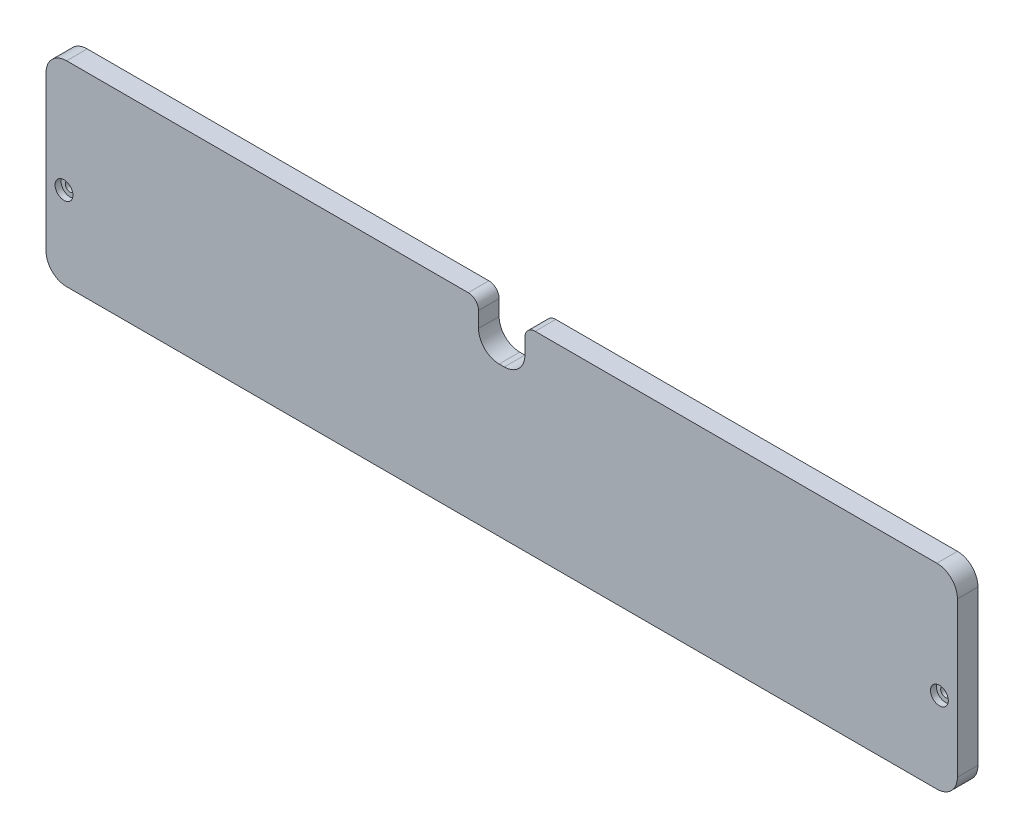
ISO-10303-21;
HEADER;
FILE_DESCRIPTION(('STEP AP214'),'2;1');
FILE_NAME('part.step','',(''),(''),'','','');
FILE_SCHEMA(('AUTOMOTIVE_DESIGN { 1 0 10303 214 1 1 1 1 }'));
ENDSEC;
DATA;
#1=APPLICATION_CONTEXT('core data for automotive mechanical design processes');
#2=APPLICATION_PROTOCOL_DEFINITION('international standard','automotive_design',2000,#1);
#3=PRODUCT_CONTEXT('',#1,'mechanical');
#4=PRODUCT('Part','Part','',(#3));
#5=PRODUCT_RELATED_PRODUCT_CATEGORY('part','',(#4));
#6=PRODUCT_DEFINITION_FORMATION('','',#4);
#7=PRODUCT_DEFINITION_CONTEXT('part definition',#1,'design');
#8=PRODUCT_DEFINITION('design','',#6,#7);
#9=PRODUCT_DEFINITION_SHAPE('','',#8);
#10=(LENGTH_UNIT() NAMED_UNIT(*) SI_UNIT(.MILLI.,.METRE.));
#11=(NAMED_UNIT(*) PLANE_ANGLE_UNIT() SI_UNIT($,.RADIAN.));
#12=(NAMED_UNIT(*) SI_UNIT($,.STERADIAN.) SOLID_ANGLE_UNIT());
#13=UNCERTAINTY_MEASURE_WITH_UNIT(LENGTH_MEASURE(1.E-05),#10,'distance_accuracy_value','');
#14=(GEOMETRIC_REPRESENTATION_CONTEXT(3) GLOBAL_UNCERTAINTY_ASSIGNED_CONTEXT((#13)) GLOBAL_UNIT_ASSIGNED_CONTEXT((#10,
#11,#12)) REPRESENTATION_CONTEXT('',''));
#15=CARTESIAN_POINT('',(0.,0.,0.));
#16=DIRECTION('',(0.,0.,1.));
#17=DIRECTION('',(1.,0.,0.));
#18=AXIS2_PLACEMENT_3D('',#15,#16,#17);
#19=CARTESIAN_POINT('',(12.7,12.7,12.7));
#20=DIRECTION('',(0.,0.,-1.));
#21=DIRECTION('',(-1.,0.,0.));
#22=AXIS2_PLACEMENT_3D('',#19,#20,#21);
#23=CYLINDRICAL_SURFACE('',#22,12.7);
#24=CARTESIAN_POINT('',(12.7,12.7,0.));
#25=DIRECTION('',(0.,0.,1.));
#26=DIRECTION('',(1.,0.,0.));
#27=AXIS2_PLACEMENT_3D('',#24,#25,#26);
#28=CIRCLE('',#27,12.7);
#29=CARTESIAN_POINT('',(0.,12.7000000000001,0.));
#30=VERTEX_POINT('',#29);
#31=CARTESIAN_POINT('',(12.7000000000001,0.,0.));
#32=VERTEX_POINT('',#31);
#33=EDGE_CURVE('E176',#30,#32,#28,.T.);
#34=ORIENTED_EDGE('',*,*,#33,.T.);
#35=DIRECTION('',(0.,0.,-1.));
#36=VECTOR('',#35,1.);
#37=CARTESIAN_POINT('',(12.7000000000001,0.,12.7));
#38=LINE('',#37,#36);
#39=CARTESIAN_POINT('',(12.7000000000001,0.,12.7));
#40=VERTEX_POINT('',#39);
#41=EDGE_CURVE('E11',#40,#32,#38,.T.);
#42=ORIENTED_EDGE('',*,*,#41,.F.);
#43=CARTESIAN_POINT('',(12.7,12.7,12.7));
#44=DIRECTION('',(0.,0.,1.));
#45=DIRECTION('',(1.,0.,0.));
#46=AXIS2_PLACEMENT_3D('',#43,#44,#45);
#47=CIRCLE('',#46,12.7);
#48=CARTESIAN_POINT('',(0.,12.7000000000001,12.7));
#49=VERTEX_POINT('',#48);
#50=EDGE_CURVE('E207',#49,#40,#47,.T.);
#51=ORIENTED_EDGE('',*,*,#50,.F.);
#52=DIRECTION('',(0.,0.,-1.));
#53=VECTOR('',#52,1.);
#54=CARTESIAN_POINT('',(0.,12.7000000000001,12.7));
#55=LINE('',#54,#53);
#56=EDGE_CURVE('E172',#49,#30,#55,.T.);
#57=ORIENTED_EDGE('',*,*,#56,.T.);
#58=EDGE_LOOP('',(#34,#42,#51,#57));
#59=FACE_BOUND('',#58,.T.);
#60=ADVANCED_FACE('F32',(#59),#23,.T.);
#61=CARTESIAN_POINT('',(12.7000000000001,0.,12.7));
#62=DIRECTION('',(0.,1.,0.));
#63=DIRECTION('',(0.,0.,1.));
#64=AXIS2_PLACEMENT_3D('',#61,#62,#63);
#65=PLANE('',#64);
#66=DIRECTION('',(1.,0.,0.));
#67=VECTOR('',#66,1.);
#68=CARTESIAN_POINT('',(12.7000000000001,0.,0.));
#69=LINE('',#68,#67);
#70=CARTESIAN_POINT('',(549.275,0.,0.));
#71=VERTEX_POINT('',#70);
#72=EDGE_CURVE('E179',#32,#71,#69,.T.);
#73=ORIENTED_EDGE('',*,*,#72,.T.);
#74=DIRECTION('',(0.,0.,-1.));
#75=VECTOR('',#74,1.);
#76=CARTESIAN_POINT('',(549.275,0.,12.7));
#77=LINE('',#76,#75);
#78=CARTESIAN_POINT('',(549.275,0.,12.7));
#79=VERTEX_POINT('',#78);
#80=EDGE_CURVE('E40',#79,#71,#77,.T.);
#81=ORIENTED_EDGE('',*,*,#80,.F.);
#82=DIRECTION('',(1.,0.,0.));
#83=VECTOR('',#82,1.);
#84=CARTESIAN_POINT('',(12.7000000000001,0.,12.7));
#85=LINE('',#84,#83);
#86=EDGE_CURVE('E115',#40,#79,#85,.T.);
#87=ORIENTED_EDGE('',*,*,#86,.F.);
#88=ORIENTED_EDGE('',*,*,#41,.T.);
#89=EDGE_LOOP('',(#73,#81,#87,#88));
#90=FACE_BOUND('',#89,.T.);
#91=ADVANCED_FACE('F306',(#90),#65,.F.);
#92=CARTESIAN_POINT('',(549.275,12.7,12.7));
#93=DIRECTION('',(0.,0.,-1.));
#94=DIRECTION('',(-1.,0.,0.));
#95=AXIS2_PLACEMENT_3D('',#92,#93,#94);
#96=CYLINDRICAL_SURFACE('',#95,12.7);
#97=CARTESIAN_POINT('',(549.275,12.7,0.));
#98=DIRECTION('',(0.,0.,1.));
#99=DIRECTION('',(1.,0.,0.));
#100=AXIS2_PLACEMENT_3D('',#97,#98,#99);
#101=CIRCLE('',#100,12.7);
#102=CARTESIAN_POINT('',(561.975,12.7000000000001,0.));
#103=VERTEX_POINT('',#102);
#104=EDGE_CURVE('E182',#71,#103,#101,.T.);
#105=ORIENTED_EDGE('',*,*,#104,.T.);
#106=DIRECTION('',(0.,0.,-1.));
#107=VECTOR('',#106,1.);
#108=CARTESIAN_POINT('',(561.975,12.7000000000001,12.7));
#109=LINE('',#108,#107);
#110=CARTESIAN_POINT('',(561.975,12.7000000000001,12.7));
#111=VERTEX_POINT('',#110);
#112=EDGE_CURVE('E238',#111,#103,#109,.T.);
#113=ORIENTED_EDGE('',*,*,#112,.F.);
#114=CARTESIAN_POINT('',(549.275,12.7,12.7));
#115=DIRECTION('',(0.,0.,1.));
#116=DIRECTION('',(1.,0.,0.));
#117=AXIS2_PLACEMENT_3D('',#114,#115,#116);
#118=CIRCLE('',#117,12.7);
#119=EDGE_CURVE('E246',#79,#111,#118,.T.);
#120=ORIENTED_EDGE('',*,*,#119,.F.);
#121=ORIENTED_EDGE('',*,*,#80,.T.);
#122=EDGE_LOOP('',(#105,#113,#120,#121));
#123=FACE_BOUND('',#122,.T.);
#124=ADVANCED_FACE('F244',(#123),#96,.T.);
#125=CARTESIAN_POINT('',(561.975,12.7000000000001,12.7));
#126=DIRECTION('',(-1.,0.,0.));
#127=DIRECTION('',(0.,0.,1.));
#128=AXIS2_PLACEMENT_3D('',#125,#126,#127);
#129=PLANE('',#128);
#130=DIRECTION('',(0.,1.,0.));
#131=VECTOR('',#130,1.);
#132=CARTESIAN_POINT('',(561.975,12.7000000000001,0.));
#133=LINE('',#132,#131);
#134=CARTESIAN_POINT('',(561.975,107.95,0.));
#135=VERTEX_POINT('',#134);
#136=EDGE_CURVE('E184',#103,#135,#133,.T.);
#137=ORIENTED_EDGE('',*,*,#136,.T.);
#138=DIRECTION('',(0.,0.,-1.));
#139=VECTOR('',#138,1.);
#140=CARTESIAN_POINT('',(561.975,107.95,12.7));
#141=LINE('',#140,#139);
#142=CARTESIAN_POINT('',(561.975,107.95,12.7));
#143=VERTEX_POINT('',#142);
#144=EDGE_CURVE('E235',#143,#135,#141,.T.);
#145=ORIENTED_EDGE('',*,*,#144,.F.);
#146=DIRECTION('',(0.,1.,0.));
#147=VECTOR('',#146,1.);
#148=CARTESIAN_POINT('',(561.975,12.7000000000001,12.7));
#149=LINE('',#148,#147);
#150=EDGE_CURVE('E264',#111,#143,#149,.T.);
#151=ORIENTED_EDGE('',*,*,#150,.F.);
#152=ORIENTED_EDGE('',*,*,#112,.T.);
#153=EDGE_LOOP('',(#137,#145,#151,#152));
#154=FACE_BOUND('',#153,.T.);
#155=ADVANCED_FACE('F255',(#154),#129,.F.);
#156=CARTESIAN_POINT('',(549.275,107.95,12.7));
#157=DIRECTION('',(0.,0.,-1.));
#158=DIRECTION('',(-1.,0.,0.));
#159=AXIS2_PLACEMENT_3D('',#156,#157,#158);
#160=CYLINDRICAL_SURFACE('',#159,12.7);
#161=CARTESIAN_POINT('',(549.275,107.95,0.));
#162=DIRECTION('',(0.,0.,1.));
#163=DIRECTION('',(1.,0.,0.));
#164=AXIS2_PLACEMENT_3D('',#161,#162,#163);
#165=CIRCLE('',#164,12.7);
#166=CARTESIAN_POINT('',(549.275,120.65,0.));
#167=VERTEX_POINT('',#166);
#168=EDGE_CURVE('E186',#135,#167,#165,.T.);
#169=ORIENTED_EDGE('',*,*,#168,.T.);
#170=DIRECTION('',(0.,0.,-1.));
#171=VECTOR('',#170,1.);
#172=CARTESIAN_POINT('',(549.275,120.65,12.7));
#173=LINE('',#172,#171);
#174=CARTESIAN_POINT('',(549.275,120.65,12.7));
#175=VERTEX_POINT('',#174);
#176=EDGE_CURVE('E232',#175,#167,#173,.T.);
#177=ORIENTED_EDGE('',*,*,#176,.F.);
#178=CARTESIAN_POINT('',(549.275,107.95,12.7));
#179=DIRECTION('',(0.,0.,1.));
#180=DIRECTION('',(1.,0.,0.));
#181=AXIS2_PLACEMENT_3D('',#178,#179,#180);
#182=CIRCLE('',#181,12.7);
#183=EDGE_CURVE('E261',#143,#175,#182,.T.);
#184=ORIENTED_EDGE('',*,*,#183,.F.);
#185=ORIENTED_EDGE('',*,*,#144,.T.);
#186=EDGE_LOOP('',(#169,#177,#184,#185));
#187=FACE_BOUND('',#186,.T.);
#188=ADVANCED_FACE('F259',(#187),#160,.T.);
#189=CARTESIAN_POINT('',(549.275,120.65,12.7));
#190=DIRECTION('',(0.,-1.,0.));
#191=DIRECTION('',(1.,0.,0.));
#192=AXIS2_PLACEMENT_3D('',#189,#190,#191);
#193=PLANE('',#192);
#194=DIRECTION('',(-1.,0.,0.));
#195=VECTOR('',#194,1.);
#196=CARTESIAN_POINT('',(549.275,120.65,0.));
#197=LINE('',#196,#195);
#198=CARTESIAN_POINT('',(301.625,120.65,0.));
#199=VERTEX_POINT('',#198);
#200=EDGE_CURVE('E188',#167,#199,#197,.T.);
#201=ORIENTED_EDGE('',*,*,#200,.T.);
#202=DIRECTION('',(0.,0.,-1.));
#203=VECTOR('',#202,1.);
#204=CARTESIAN_POINT('',(301.625,120.65,12.7));
#205=LINE('',#204,#203);
#206=CARTESIAN_POINT('',(301.625,120.65,12.7));
#207=VERTEX_POINT('',#206);
#208=EDGE_CURVE('E229',#207,#199,#205,.T.);
#209=ORIENTED_EDGE('',*,*,#208,.F.);
#210=DIRECTION('',(-1.,0.,0.));
#211=VECTOR('',#210,1.);
#212=CARTESIAN_POINT('',(549.275,120.65,12.7));
#213=LINE('',#212,#211);
#214=EDGE_CURVE('E263',#175,#207,#213,.T.);
#215=ORIENTED_EDGE('',*,*,#214,.F.);
#216=ORIENTED_EDGE('',*,*,#176,.T.);
#217=EDGE_LOOP('',(#201,#209,#215,#216));
#218=FACE_BOUND('',#217,.T.);
#219=ADVANCED_FACE('F319',(#218),#193,.F.);
#220=CARTESIAN_POINT('',(301.625,114.3,12.7));
#221=DIRECTION('',(0.,0.,-1.));
#222=DIRECTION('',(-1.,0.,0.));
#223=AXIS2_PLACEMENT_3D('',#220,#221,#222);
#224=CYLINDRICAL_SURFACE('',#223,6.35);
#225=CARTESIAN_POINT('',(301.625,114.3,0.));
#226=DIRECTION('',(0.,0.,1.));
#227=DIRECTION('',(1.,0.,0.));
#228=AXIS2_PLACEMENT_3D('',#225,#226,#227);
#229=CIRCLE('',#228,6.35);
#230=CARTESIAN_POINT('',(295.275,114.3,0.));
#231=VERTEX_POINT('',#230);
#232=EDGE_CURVE('E190',#199,#231,#229,.T.);
#233=ORIENTED_EDGE('',*,*,#232,.T.);
#234=DIRECTION('',(0.,0.,-1.));
#235=VECTOR('',#234,1.);
#236=CARTESIAN_POINT('',(295.275,114.3,12.7));
#237=LINE('',#236,#235);
#238=CARTESIAN_POINT('',(295.275,114.3,12.7));
#239=VERTEX_POINT('',#238);
#240=EDGE_CURVE('E226',#239,#231,#237,.T.);
#241=ORIENTED_EDGE('',*,*,#240,.F.);
#242=CARTESIAN_POINT('',(301.625,114.3,12.7));
#243=DIRECTION('',(0.,0.,1.));
#244=DIRECTION('',(1.,0.,0.));
#245=AXIS2_PLACEMENT_3D('',#242,#243,#244);
#246=CIRCLE('',#245,6.35);
#247=EDGE_CURVE('E266',#207,#239,#246,.T.);
#248=ORIENTED_EDGE('',*,*,#247,.F.);
#249=ORIENTED_EDGE('',*,*,#208,.T.);
#250=EDGE_LOOP('',(#233,#241,#248,#249));
#251=FACE_BOUND('',#250,.T.);
#252=ADVANCED_FACE('F322',(#251),#224,.T.);
#253=CARTESIAN_POINT('',(295.275,114.3,12.7));
#254=DIRECTION('',(1.,0.,0.));
#255=DIRECTION('',(0.,0.,-1.));
#256=AXIS2_PLACEMENT_3D('',#253,#254,#255);
#257=PLANE('',#256);
#258=DIRECTION('',(0.,-1.,0.));
#259=VECTOR('',#258,1.);
#260=CARTESIAN_POINT('',(295.275,114.3,0.));
#261=LINE('',#260,#259);
#262=CARTESIAN_POINT('',(295.275,104.775,0.));
#263=VERTEX_POINT('',#262);
#264=EDGE_CURVE('E192',#231,#263,#261,.T.);
#265=ORIENTED_EDGE('',*,*,#264,.T.);
#266=DIRECTION('',(0.,0.,-1.));
#267=VECTOR('',#266,1.);
#268=CARTESIAN_POINT('',(295.275,104.775,12.7));
#269=LINE('',#268,#267);
#270=CARTESIAN_POINT('',(295.275,104.775,12.7));
#271=VERTEX_POINT('',#270);
#272=EDGE_CURVE('E223',#271,#263,#269,.T.);
#273=ORIENTED_EDGE('',*,*,#272,.F.);
#274=DIRECTION('',(0.,-1.,0.));
#275=VECTOR('',#274,1.);
#276=CARTESIAN_POINT('',(295.275,114.3,12.7));
#277=LINE('',#276,#275);
#278=EDGE_CURVE('E272',#239,#271,#277,.T.);
#279=ORIENTED_EDGE('',*,*,#278,.F.);
#280=ORIENTED_EDGE('',*,*,#240,.T.);
#281=EDGE_LOOP('',(#265,#273,#279,#280));
#282=FACE_BOUND('',#281,.T.);
#283=ADVANCED_FACE('F326',(#282),#257,.F.);
#284=CARTESIAN_POINT('',(282.575,104.775,12.7));
#285=DIRECTION('',(0.,0.,-1.));
#286=DIRECTION('',(-1.,0.,0.));
#287=AXIS2_PLACEMENT_3D('',#284,#285,#286);
#288=CYLINDRICAL_SURFACE('',#287,12.7);
#289=CARTESIAN_POINT('',(282.575,104.775,0.));
#290=DIRECTION('',(0.,0.,-1.));
#291=DIRECTION('',(1.,0.,0.));
#292=AXIS2_PLACEMENT_3D('',#289,#290,#291);
#293=CIRCLE('',#292,12.7);
#294=CARTESIAN_POINT('',(282.575,92.0749999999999,0.));
#295=VERTEX_POINT('',#294);
#296=EDGE_CURVE('E194',#263,#295,#293,.T.);
#297=ORIENTED_EDGE('',*,*,#296,.T.);
#298=DIRECTION('',(0.,0.,-1.));
#299=VECTOR('',#298,1.);
#300=CARTESIAN_POINT('',(282.575,92.0749999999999,12.7));
#301=LINE('',#300,#299);
#302=CARTESIAN_POINT('',(282.575,92.0749999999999,12.7));
#303=VERTEX_POINT('',#302);
#304=EDGE_CURVE('E220',#303,#295,#301,.T.);
#305=ORIENTED_EDGE('',*,*,#304,.F.);
#306=CARTESIAN_POINT('',(282.575,104.775,12.7));
#307=DIRECTION('',(0.,0.,-1.));
#308=DIRECTION('',(1.,0.,0.));
#309=AXIS2_PLACEMENT_3D('',#306,#307,#308);
#310=CIRCLE('',#309,12.7);
#311=EDGE_CURVE('E274',#271,#303,#310,.T.);
#312=ORIENTED_EDGE('',*,*,#311,.F.);
#313=ORIENTED_EDGE('',*,*,#272,.T.);
#314=EDGE_LOOP('',(#297,#305,#312,#313));
#315=FACE_BOUND('',#314,.T.);
#316=ADVANCED_FACE('F330',(#315),#288,.F.);
#317=CARTESIAN_POINT('',(282.575,92.0749999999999,12.7));
#318=DIRECTION('',(0.,-1.,0.));
#319=DIRECTION('',(1.,0.,0.));
#320=AXIS2_PLACEMENT_3D('',#317,#318,#319);
#321=PLANE('',#320);
#322=DIRECTION('',(-1.,0.,0.));
#323=VECTOR('',#322,1.);
#324=CARTESIAN_POINT('',(282.575,92.0749999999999,0.));
#325=LINE('',#324,#323);
#326=CARTESIAN_POINT('',(279.4,92.075,0.));
#327=VERTEX_POINT('',#326);
#328=EDGE_CURVE('E196',#295,#327,#325,.T.);
#329=ORIENTED_EDGE('',*,*,#328,.T.);
#330=DIRECTION('',(0.,0.,-1.));
#331=VECTOR('',#330,1.);
#332=CARTESIAN_POINT('',(279.4,92.075,12.7));
#333=LINE('',#332,#331);
#334=CARTESIAN_POINT('',(279.4,92.075,12.7));
#335=VERTEX_POINT('',#334);
#336=EDGE_CURVE('E217',#335,#327,#333,.T.);
#337=ORIENTED_EDGE('',*,*,#336,.F.);
#338=DIRECTION('',(-1.,0.,0.));
#339=VECTOR('',#338,1.);
#340=CARTESIAN_POINT('',(282.575,92.0749999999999,12.7));
#341=LINE('',#340,#339);
#342=EDGE_CURVE('E276',#303,#335,#341,.T.);
#343=ORIENTED_EDGE('',*,*,#342,.F.);
#344=ORIENTED_EDGE('',*,*,#304,.T.);
#345=EDGE_LOOP('',(#329,#337,#343,#344));
#346=FACE_BOUND('',#345,.T.);
#347=ADVANCED_FACE('F334',(#346),#321,.F.);
#348=CARTESIAN_POINT('',(279.4,104.775,12.7));
#349=DIRECTION('',(0.,0.,-1.));
#350=DIRECTION('',(-1.,0.,0.));
#351=AXIS2_PLACEMENT_3D('',#348,#349,#350);
#352=CYLINDRICAL_SURFACE('',#351,12.7);
#353=CARTESIAN_POINT('',(279.4,104.775,0.));
#354=DIRECTION('',(0.,0.,-1.));
#355=DIRECTION('',(-1.,0.,0.));
#356=AXIS2_PLACEMENT_3D('',#353,#354,#355);
#357=CIRCLE('',#356,12.7);
#358=CARTESIAN_POINT('',(266.7,104.775,0.));
#359=VERTEX_POINT('',#358);
#360=EDGE_CURVE('E198',#327,#359,#357,.T.);
#361=ORIENTED_EDGE('',*,*,#360,.T.);
#362=DIRECTION('',(0.,0.,-1.));
#363=VECTOR('',#362,1.);
#364=CARTESIAN_POINT('',(266.7,104.775,12.7));
#365=LINE('',#364,#363);
#366=CARTESIAN_POINT('',(266.7,104.775,12.7));
#367=VERTEX_POINT('',#366);
#368=EDGE_CURVE('E214',#367,#359,#365,.T.);
#369=ORIENTED_EDGE('',*,*,#368,.F.);
#370=CARTESIAN_POINT('',(279.4,104.775,12.7));
#371=DIRECTION('',(0.,0.,-1.));
#372=DIRECTION('',(-1.,0.,0.));
#373=AXIS2_PLACEMENT_3D('',#370,#371,#372);
#374=CIRCLE('',#373,12.7);
#375=EDGE_CURVE('E278',#335,#367,#374,.T.);
#376=ORIENTED_EDGE('',*,*,#375,.F.);
#377=ORIENTED_EDGE('',*,*,#336,.T.);
#378=EDGE_LOOP('',(#361,#369,#376,#377));
#379=FACE_BOUND('',#378,.T.);
#380=ADVANCED_FACE('F338',(#379),#352,.F.);
#381=CARTESIAN_POINT('',(266.7,104.775,12.7));
#382=DIRECTION('',(-1.,0.,0.));
#383=DIRECTION('',(0.,0.,1.));
#384=AXIS2_PLACEMENT_3D('',#381,#382,#383);
#385=PLANE('',#384);
#386=DIRECTION('',(0.,1.,0.));
#387=VECTOR('',#386,1.);
#388=CARTESIAN_POINT('',(266.7,104.775,0.));
#389=LINE('',#388,#387);
#390=CARTESIAN_POINT('',(266.7,114.3,0.));
#391=VERTEX_POINT('',#390);
#392=EDGE_CURVE('E200',#359,#391,#389,.T.);
#393=ORIENTED_EDGE('',*,*,#392,.T.);
#394=DIRECTION('',(0.,0.,-1.));
#395=VECTOR('',#394,1.);
#396=CARTESIAN_POINT('',(266.7,114.3,12.7));
#397=LINE('',#396,#395);
#398=CARTESIAN_POINT('',(266.7,114.3,12.7));
#399=VERTEX_POINT('',#398);
#400=EDGE_CURVE('E211',#399,#391,#397,.T.);
#401=ORIENTED_EDGE('',*,*,#400,.F.);
#402=DIRECTION('',(0.,1.,0.));
#403=VECTOR('',#402,1.);
#404=CARTESIAN_POINT('',(266.7,104.775,12.7));
#405=LINE('',#404,#403);
#406=EDGE_CURVE('E280',#367,#399,#405,.T.);
#407=ORIENTED_EDGE('',*,*,#406,.F.);
#408=ORIENTED_EDGE('',*,*,#368,.T.);
#409=EDGE_LOOP('',(#393,#401,#407,#408));
#410=FACE_BOUND('',#409,.T.);
#411=ADVANCED_FACE('F286',(#410),#385,.F.);
#412=CARTESIAN_POINT('',(260.35,114.3,12.7));
#413=DIRECTION('',(0.,0.,-1.));
#414=DIRECTION('',(-1.,0.,0.));
#415=AXIS2_PLACEMENT_3D('',#412,#413,#414);
#416=CYLINDRICAL_SURFACE('',#415,6.35);
#417=CARTESIAN_POINT('',(260.35,114.3,0.));
#418=DIRECTION('',(0.,0.,1.));
#419=DIRECTION('',(1.,0.,0.));
#420=AXIS2_PLACEMENT_3D('',#417,#418,#419);
#421=CIRCLE('',#420,6.35);
#422=CARTESIAN_POINT('',(260.35,120.65,0.));
#423=VERTEX_POINT('',#422);
#424=EDGE_CURVE('E202',#391,#423,#421,.T.);
#425=ORIENTED_EDGE('',*,*,#424,.T.);
#426=DIRECTION('',(0.,0.,-1.));
#427=VECTOR('',#426,1.);
#428=CARTESIAN_POINT('',(260.35,120.65,12.7));
#429=LINE('',#428,#427);
#430=CARTESIAN_POINT('',(260.35,120.65,12.7));
#431=VERTEX_POINT('',#430);
#432=EDGE_CURVE('E167',#431,#423,#429,.T.);
#433=ORIENTED_EDGE('',*,*,#432,.F.);
#434=CARTESIAN_POINT('',(260.35,114.3,12.7));
#435=DIRECTION('',(0.,0.,1.));
#436=DIRECTION('',(1.,0.,0.));
#437=AXIS2_PLACEMENT_3D('',#434,#435,#436);
#438=CIRCLE('',#437,6.35);
#439=EDGE_CURVE('E158',#399,#431,#438,.T.);
#440=ORIENTED_EDGE('',*,*,#439,.F.);
#441=ORIENTED_EDGE('',*,*,#400,.T.);
#442=EDGE_LOOP('',(#425,#433,#440,#441));
#443=FACE_BOUND('',#442,.T.);
#444=ADVANCED_FACE('F290',(#443),#416,.T.);
#445=CARTESIAN_POINT('',(260.35,120.65,12.7));
#446=DIRECTION('',(0.,-1.,0.));
#447=DIRECTION('',(1.,0.,0.));
#448=AXIS2_PLACEMENT_3D('',#445,#446,#447);
#449=PLANE('',#448);
#450=DIRECTION('',(-1.,0.,0.));
#451=VECTOR('',#450,1.);
#452=CARTESIAN_POINT('',(260.35,120.65,0.));
#453=LINE('',#452,#451);
#454=CARTESIAN_POINT('',(12.7,120.65,0.));
#455=VERTEX_POINT('',#454);
#456=EDGE_CURVE('E166',#423,#455,#453,.T.);
#457=ORIENTED_EDGE('',*,*,#456,.T.);
#458=DIRECTION('',(0.,0.,-1.));
#459=VECTOR('',#458,1.);
#460=CARTESIAN_POINT('',(12.7,120.65,12.7));
#461=LINE('',#460,#459);
#462=CARTESIAN_POINT('',(12.7,120.65,12.7));
#463=VERTEX_POINT('',#462);
#464=EDGE_CURVE('E163',#463,#455,#461,.T.);
#465=ORIENTED_EDGE('',*,*,#464,.F.);
#466=DIRECTION('',(-1.,0.,0.));
#467=VECTOR('',#466,1.);
#468=CARTESIAN_POINT('',(260.35,120.65,12.7));
#469=LINE('',#468,#467);
#470=EDGE_CURVE('E152',#431,#463,#469,.T.);
#471=ORIENTED_EDGE('',*,*,#470,.F.);
#472=ORIENTED_EDGE('',*,*,#432,.T.);
#473=EDGE_LOOP('',(#457,#465,#471,#472));
#474=FACE_BOUND('',#473,.T.);
#475=ADVANCED_FACE('F164',(#474),#449,.F.);
#476=CARTESIAN_POINT('',(12.7,107.95,12.7));
#477=DIRECTION('',(0.,0.,-1.));
#478=DIRECTION('',(-1.,0.,0.));
#479=AXIS2_PLACEMENT_3D('',#476,#477,#478);
#480=CYLINDRICAL_SURFACE('',#479,12.7);
#481=CARTESIAN_POINT('',(12.7,107.95,0.));
#482=DIRECTION('',(0.,0.,1.));
#483=DIRECTION('',(1.,0.,0.));
#484=AXIS2_PLACEMENT_3D('',#481,#482,#483);
#485=CIRCLE('',#484,12.7);
#486=CARTESIAN_POINT('',(0.,107.95,0.));
#487=VERTEX_POINT('',#486);
#488=EDGE_CURVE('E101',#455,#487,#485,.T.);
#489=ORIENTED_EDGE('',*,*,#488,.T.);
#490=DIRECTION('',(0.,0.,-1.));
#491=VECTOR('',#490,1.);
#492=CARTESIAN_POINT('',(0.,107.95,12.7));
#493=LINE('',#492,#491);
#494=CARTESIAN_POINT('',(0.,107.95,12.7));
#495=VERTEX_POINT('',#494);
#496=EDGE_CURVE('E168',#495,#487,#493,.T.);
#497=ORIENTED_EDGE('',*,*,#496,.F.);
#498=CARTESIAN_POINT('',(12.7,107.95,12.7));
#499=DIRECTION('',(0.,0.,1.));
#500=DIRECTION('',(1.,0.,0.));
#501=AXIS2_PLACEMENT_3D('',#498,#499,#500);
#502=CIRCLE('',#501,12.7);
#503=EDGE_CURVE('E156',#463,#495,#502,.T.);
#504=ORIENTED_EDGE('',*,*,#503,.F.);
#505=ORIENTED_EDGE('',*,*,#464,.T.);
#506=EDGE_LOOP('',(#489,#497,#504,#505));
#507=FACE_BOUND('',#506,.T.);
#508=ADVANCED_FACE('F170',(#507),#480,.T.);
#509=CARTESIAN_POINT('',(0.,107.95,12.7));
#510=DIRECTION('',(1.,0.,0.));
#511=DIRECTION('',(0.,0.,-1.));
#512=AXIS2_PLACEMENT_3D('',#509,#510,#511);
#513=PLANE('',#512);
#514=DIRECTION('',(0.,-1.,0.));
#515=VECTOR('',#514,1.);
#516=CARTESIAN_POINT('',(0.,107.95,0.));
#517=LINE('',#516,#515);
#518=EDGE_CURVE('E107',#487,#30,#517,.T.);
#519=ORIENTED_EDGE('',*,*,#518,.T.);
#520=ORIENTED_EDGE('',*,*,#56,.F.);
#521=DIRECTION('',(0.,-1.,0.));
#522=VECTOR('',#521,1.);
#523=CARTESIAN_POINT('',(0.,107.95,12.7));
#524=LINE('',#523,#522);
#525=EDGE_CURVE('E48',#495,#49,#524,.T.);
#526=ORIENTED_EDGE('',*,*,#525,.F.);
#527=ORIENTED_EDGE('',*,*,#496,.T.);
#528=EDGE_LOOP('',(#519,#520,#526,#527));
#529=FACE_BOUND('',#528,.T.);
#530=ADVANCED_FACE('F294',(#529),#513,.F.);
#531=CARTESIAN_POINT('',(12.7,12.7,12.7));
#532=DIRECTION('',(0.,0.,1.));
#533=DIRECTION('',(1.,0.,0.));
#534=AXIS2_PLACEMENT_3D('',#531,#532,#533);
#535=PLANE('',#534);
#536=CARTESIAN_POINT('',(11.1125,50.8,12.7));
#537=DIRECTION('',(0.,0.,1.));
#538=DIRECTION('',(1.,0.,0.));
#539=AXIS2_PLACEMENT_3D('',#536,#537,#538);
#540=CIRCLE('',#539,5.49999999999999);
#541=CARTESIAN_POINT('',(16.6125,50.8,12.7));
#542=VERTEX_POINT('',#541);
#543=EDGE_CURVE('E444',#542,#542,#540,.T.);
#544=ORIENTED_EDGE('',*,*,#543,.F.);
#545=EDGE_LOOP('',(#544));
#546=FACE_BOUND('',#545,.T.);
#547=CARTESIAN_POINT('',(550.8625,50.8,12.7));
#548=DIRECTION('',(0.,0.,1.));
#549=DIRECTION('',(1.,0.,0.));
#550=AXIS2_PLACEMENT_3D('',#547,#548,#549);
#551=CIRCLE('',#550,5.49999999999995);
#552=CARTESIAN_POINT('',(556.3625,50.8,12.7));
#553=VERTEX_POINT('',#552);
#554=EDGE_CURVE('E454',#553,#553,#551,.T.);
#555=ORIENTED_EDGE('',*,*,#554,.F.);
#556=EDGE_LOOP('',(#555));
#557=FACE_BOUND('',#556,.T.);
#558=ORIENTED_EDGE('',*,*,#50,.T.);
#559=ORIENTED_EDGE('',*,*,#86,.T.);
#560=ORIENTED_EDGE('',*,*,#119,.T.);
#561=ORIENTED_EDGE('',*,*,#150,.T.);
#562=ORIENTED_EDGE('',*,*,#183,.T.);
#563=ORIENTED_EDGE('',*,*,#214,.T.);
#564=ORIENTED_EDGE('',*,*,#247,.T.);
#565=ORIENTED_EDGE('',*,*,#278,.T.);
#566=ORIENTED_EDGE('',*,*,#311,.T.);
#567=ORIENTED_EDGE('',*,*,#342,.T.);
#568=ORIENTED_EDGE('',*,*,#375,.T.);
#569=ORIENTED_EDGE('',*,*,#406,.T.);
#570=ORIENTED_EDGE('',*,*,#439,.T.);
#571=ORIENTED_EDGE('',*,*,#470,.T.);
#572=ORIENTED_EDGE('',*,*,#503,.T.);
#573=ORIENTED_EDGE('',*,*,#525,.T.);
#574=EDGE_LOOP('',(#558,#559,#560,#561,#562,#563,#564,#565,#566,#567,#568,#569,#570,#571,#572,#573));
#575=FACE_BOUND('',#574,.T.);
#576=ADVANCED_FACE('F154',(#546,#557,#575),#535,.T.);
#577=CARTESIAN_POINT('',(12.7,12.7,0.));
#578=DIRECTION('',(0.,0.,1.));
#579=DIRECTION('',(1.,0.,0.));
#580=AXIS2_PLACEMENT_3D('',#577,#578,#579);
#581=PLANE('',#580);
#582=CARTESIAN_POINT('',(11.1125,50.8,0.));
#583=DIRECTION('',(0.,0.,1.));
#584=DIRECTION('',(1.,0.,0.));
#585=AXIS2_PLACEMENT_3D('',#582,#583,#584);
#586=CIRCLE('',#585,2.9);
#587=CARTESIAN_POINT('',(14.0125,50.8,0.));
#588=VERTEX_POINT('',#587);
#589=EDGE_CURVE('E451',#588,#588,#586,.T.);
#590=ORIENTED_EDGE('',*,*,#589,.T.);
#591=EDGE_LOOP('',(#590));
#592=FACE_BOUND('',#591,.T.);
#593=CARTESIAN_POINT('',(550.8625,50.8,0.));
#594=DIRECTION('',(0.,0.,1.));
#595=DIRECTION('',(1.,0.,0.));
#596=AXIS2_PLACEMENT_3D('',#593,#594,#595);
#597=CIRCLE('',#596,2.90000000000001);
#598=CARTESIAN_POINT('',(553.7625,50.8,0.));
#599=VERTEX_POINT('',#598);
#600=EDGE_CURVE('E180',#599,#599,#597,.T.);
#601=ORIENTED_EDGE('',*,*,#600,.T.);
#602=EDGE_LOOP('',(#601));
#603=FACE_BOUND('',#602,.T.);
#604=ORIENTED_EDGE('',*,*,#33,.F.);
#605=ORIENTED_EDGE('',*,*,#518,.F.);
#606=ORIENTED_EDGE('',*,*,#488,.F.);
#607=ORIENTED_EDGE('',*,*,#456,.F.);
#608=ORIENTED_EDGE('',*,*,#424,.F.);
#609=ORIENTED_EDGE('',*,*,#392,.F.);
#610=ORIENTED_EDGE('',*,*,#360,.F.);
#611=ORIENTED_EDGE('',*,*,#328,.F.);
#612=ORIENTED_EDGE('',*,*,#296,.F.);
#613=ORIENTED_EDGE('',*,*,#264,.F.);
#614=ORIENTED_EDGE('',*,*,#232,.F.);
#615=ORIENTED_EDGE('',*,*,#200,.F.);
#616=ORIENTED_EDGE('',*,*,#168,.F.);
#617=ORIENTED_EDGE('',*,*,#136,.F.);
#618=ORIENTED_EDGE('',*,*,#104,.F.);
#619=ORIENTED_EDGE('',*,*,#72,.F.);
#620=EDGE_LOOP('',(#604,#605,#606,#607,#608,#609,#610,#611,#612,#613,#614,#615,#616,#617,#618,#619));
#621=FACE_BOUND('',#620,.T.);
#622=ADVANCED_FACE('F250',(#592,#603,#621),#581,.F.);
#623=CARTESIAN_POINT('',(550.8625,50.8,12.7));
#624=DIRECTION('',(0.,0.,1.));
#625=DIRECTION('',(1.,0.,0.));
#626=AXIS2_PLACEMENT_3D('',#623,#624,#625);
#627=CYLINDRICAL_SURFACE('',#626,2.90000000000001);
#628=ORIENTED_EDGE('',*,*,#600,.F.);
#629=EDGE_LOOP('',(#628));
#630=FACE_BOUND('',#629,.T.);
#631=CARTESIAN_POINT('',(550.8625,50.8,9.));
#632=DIRECTION('',(0.,0.,1.));
#633=DIRECTION('',(1.,0.,0.));
#634=AXIS2_PLACEMENT_3D('',#631,#632,#633);
#635=CIRCLE('',#634,2.90000000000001);
#636=CARTESIAN_POINT('',(553.7625,50.8,9.));
#637=VERTEX_POINT('',#636);
#638=EDGE_CURVE('E460',#637,#637,#635,.T.);
#639=ORIENTED_EDGE('',*,*,#638,.T.);
#640=EDGE_LOOP('',(#639));
#641=FACE_BOUND('',#640,.T.);
#642=ADVANCED_FACE('F375',(#630,#641),#627,.F.);
#643=CARTESIAN_POINT('',(553.7625,50.8,9.));
#644=DIRECTION('',(0.,0.,-1.));
#645=DIRECTION('',(-1.,0.,0.));
#646=AXIS2_PLACEMENT_3D('',#643,#644,#645);
#647=PLANE('',#646);
#648=ORIENTED_EDGE('',*,*,#638,.F.);
#649=EDGE_LOOP('',(#648));
#650=FACE_BOUND('',#649,.T.);
#651=CARTESIAN_POINT('',(550.8625,50.8,9.));
#652=DIRECTION('',(0.,0.,1.));
#653=DIRECTION('',(1.,0.,0.));
#654=AXIS2_PLACEMENT_3D('',#651,#652,#653);
#655=CIRCLE('',#654,5.49999999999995);
#656=CARTESIAN_POINT('',(556.3625,50.8,9.));
#657=VERTEX_POINT('',#656);
#658=EDGE_CURVE('E457',#657,#657,#655,.T.);
#659=ORIENTED_EDGE('',*,*,#658,.T.);
#660=EDGE_LOOP('',(#659));
#661=FACE_BOUND('',#660,.T.);
#662=ADVANCED_FACE('F384',(#650,#661),#647,.F.);
#663=CARTESIAN_POINT('',(550.8625,50.8,12.7));
#664=DIRECTION('',(0.,0.,1.));
#665=DIRECTION('',(1.,0.,0.));
#666=AXIS2_PLACEMENT_3D('',#663,#664,#665);
#667=CYLINDRICAL_SURFACE('',#666,5.49999999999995);
#668=ORIENTED_EDGE('',*,*,#658,.F.);
#669=EDGE_LOOP('',(#668));
#670=FACE_BOUND('',#669,.T.);
#671=ORIENTED_EDGE('',*,*,#554,.T.);
#672=EDGE_LOOP('',(#671));
#673=FACE_BOUND('',#672,.T.);
#674=ADVANCED_FACE('F394',(#670,#673),#667,.F.);
#675=CARTESIAN_POINT('',(11.1125,50.8,12.7));
#676=DIRECTION('',(0.,0.,1.));
#677=DIRECTION('',(1.,0.,0.));
#678=AXIS2_PLACEMENT_3D('',#675,#676,#677);
#679=CYLINDRICAL_SURFACE('',#678,2.9);
#680=ORIENTED_EDGE('',*,*,#589,.F.);
#681=EDGE_LOOP('',(#680));
#682=FACE_BOUND('',#681,.T.);
#683=CARTESIAN_POINT('',(11.1125,50.8,9.));
#684=DIRECTION('',(0.,0.,1.));
#685=DIRECTION('',(1.,0.,0.));
#686=AXIS2_PLACEMENT_3D('',#683,#684,#685);
#687=CIRCLE('',#686,2.9);
#688=CARTESIAN_POINT('',(14.0125,50.8,9.));
#689=VERTEX_POINT('',#688);
#690=EDGE_CURVE('E446',#689,#689,#687,.T.);
#691=ORIENTED_EDGE('',*,*,#690,.T.);
#692=EDGE_LOOP('',(#691));
#693=FACE_BOUND('',#692,.T.);
#694=ADVANCED_FACE('F404',(#682,#693),#679,.F.);
#695=CARTESIAN_POINT('',(14.0125,50.8,9.));
#696=DIRECTION('',(0.,0.,-1.));
#697=DIRECTION('',(-1.,0.,0.));
#698=AXIS2_PLACEMENT_3D('',#695,#696,#697);
#699=PLANE('',#698);
#700=ORIENTED_EDGE('',*,*,#690,.F.);
#701=EDGE_LOOP('',(#700));
#702=FACE_BOUND('',#701,.T.);
#703=CARTESIAN_POINT('',(11.1125,50.8,9.));
#704=DIRECTION('',(0.,0.,1.));
#705=DIRECTION('',(1.,0.,0.));
#706=AXIS2_PLACEMENT_3D('',#703,#704,#705);
#707=CIRCLE('',#706,5.5);
#708=CARTESIAN_POINT('',(16.6125,50.8,9.));
#709=VERTEX_POINT('',#708);
#710=EDGE_CURVE('E441',#709,#709,#707,.T.);
#711=ORIENTED_EDGE('',*,*,#710,.T.);
#712=EDGE_LOOP('',(#711));
#713=FACE_BOUND('',#712,.T.);
#714=ADVANCED_FACE('F414',(#702,#713),#699,.F.);
#715=CARTESIAN_POINT('',(11.1125,50.8,12.7));
#716=DIRECTION('',(0.,0.,1.));
#717=DIRECTION('',(1.,0.,0.));
#718=AXIS2_PLACEMENT_3D('',#715,#716,#717);
#719=CYLINDRICAL_SURFACE('',#718,5.5);
#720=ORIENTED_EDGE('',*,*,#710,.F.);
#721=EDGE_LOOP('',(#720));
#722=FACE_BOUND('',#721,.T.);
#723=ORIENTED_EDGE('',*,*,#543,.T.);
#724=EDGE_LOOP('',(#723));
#725=FACE_BOUND('',#724,.T.);
#726=ADVANCED_FACE('F424',(#722,#725),#719,.F.);
#727=CLOSED_SHELL('',(#60,#91,#124,#155,#188,#219,#252,#283,#316,#347,#380,#411,#444,#475,#508,
#530,#576,#622,#642,#662,#674,#694,#714,#726));
#728=MANIFOLD_SOLID_BREP('B2',#727);
#729=ADVANCED_BREP_SHAPE_REPRESENTATION('',(#18,#728),#14);
#730=SHAPE_DEFINITION_REPRESENTATION(#9,#729);
ENDSEC;
END-ISO-10303-21;
